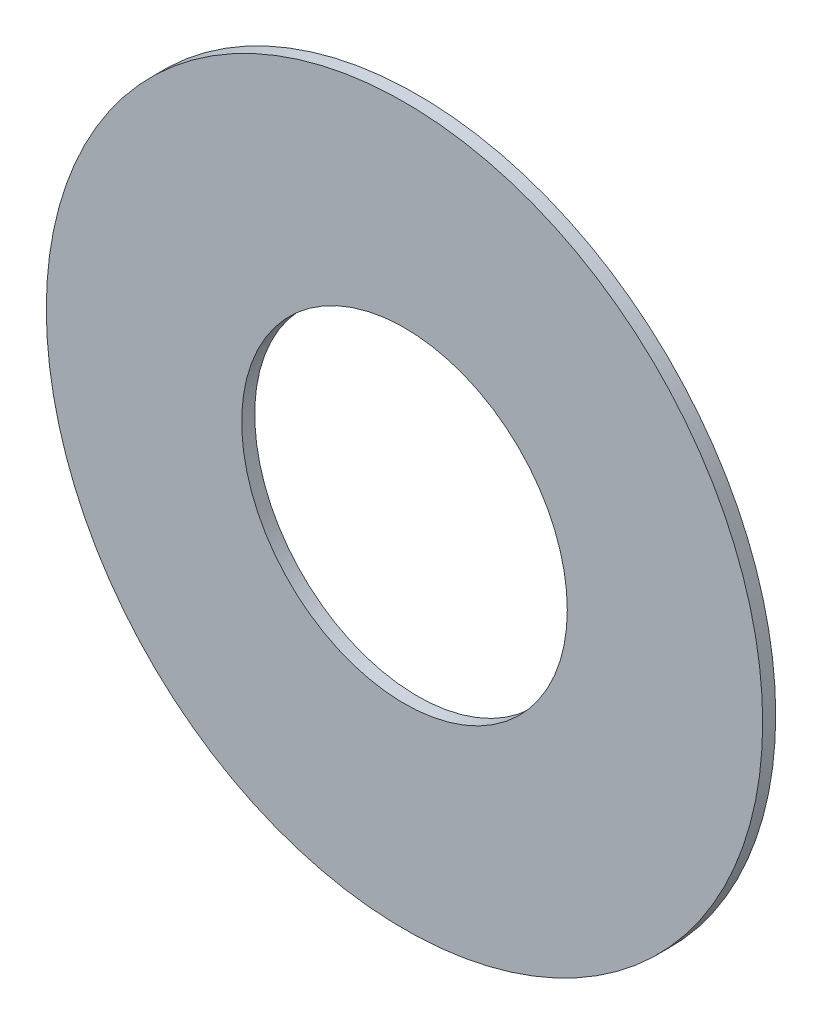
ISO-10303-21;
HEADER;
FILE_DESCRIPTION(('STEP AP214'),'2;1');
FILE_NAME('part.step','',(''),(''),'','','');
FILE_SCHEMA(('AUTOMOTIVE_DESIGN { 1 0 10303 214 1 1 1 1 }'));
ENDSEC;
DATA;
#1=APPLICATION_CONTEXT('core data for automotive mechanical design processes');
#2=APPLICATION_PROTOCOL_DEFINITION('international standard','automotive_design',2000,#1);
#3=PRODUCT_CONTEXT('',#1,'mechanical');
#4=PRODUCT('Part','Part','',(#3));
#5=PRODUCT_RELATED_PRODUCT_CATEGORY('part','',(#4));
#6=PRODUCT_DEFINITION_FORMATION('','',#4);
#7=PRODUCT_DEFINITION_CONTEXT('part definition',#1,'design');
#8=PRODUCT_DEFINITION('design','',#6,#7);
#9=PRODUCT_DEFINITION_SHAPE('','',#8);
#10=(LENGTH_UNIT() NAMED_UNIT(*) SI_UNIT(.MILLI.,.METRE.));
#11=(NAMED_UNIT(*) PLANE_ANGLE_UNIT() SI_UNIT($,.RADIAN.));
#12=(NAMED_UNIT(*) SI_UNIT($,.STERADIAN.) SOLID_ANGLE_UNIT());
#13=UNCERTAINTY_MEASURE_WITH_UNIT(LENGTH_MEASURE(1.E-05),#10,'distance_accuracy_value','');
#14=(GEOMETRIC_REPRESENTATION_CONTEXT(3) GLOBAL_UNCERTAINTY_ASSIGNED_CONTEXT((#13)) GLOBAL_UNIT_ASSIGNED_CONTEXT((#10,
#11,#12)) REPRESENTATION_CONTEXT('',''));
#15=CARTESIAN_POINT('',(0.,0.,0.));
#16=DIRECTION('',(0.,0.,1.));
#17=DIRECTION('',(1.,0.,0.));
#18=AXIS2_PLACEMENT_3D('',#15,#16,#17);
#19=CARTESIAN_POINT('',(0.,0.,0.2));
#20=DIRECTION('',(0.,0.,1.));
#21=DIRECTION('',(1.,0.,0.));
#22=AXIS2_PLACEMENT_3D('',#19,#20,#21);
#23=PLANE('',#22);
#24=CARTESIAN_POINT('',(0.,0.,0.2));
#25=DIRECTION('',(0.,0.,1.));
#26=DIRECTION('',(1.,0.,0.));
#27=AXIS2_PLACEMENT_3D('',#24,#25,#26);
#28=CIRCLE('',#27,2.5);
#29=CARTESIAN_POINT('',(2.5,0.,0.2));
#30=VERTEX_POINT('',#29);
#31=EDGE_CURVE('E26',#30,#30,#28,.F.);
#32=ORIENTED_EDGE('',*,*,#31,.T.);
#33=EDGE_LOOP('',(#32));
#34=FACE_BOUND('',#33,.T.);
#35=CARTESIAN_POINT('',(0.,0.,0.2));
#36=DIRECTION('',(0.,0.,1.));
#37=DIRECTION('',(1.,0.,0.));
#38=AXIS2_PLACEMENT_3D('',#35,#36,#37);
#39=CIRCLE('',#38,5.5);
#40=CARTESIAN_POINT('',(5.5,0.,0.2));
#41=VERTEX_POINT('',#40);
#42=EDGE_CURVE('E17',#41,#41,#39,.F.);
#43=ORIENTED_EDGE('',*,*,#42,.F.);
#44=EDGE_LOOP('',(#43));
#45=FACE_BOUND('',#44,.T.);
#46=ADVANCED_FACE('F14',(#34,#45),#23,.T.);
#47=CARTESIAN_POINT('',(0.,0.,0.1));
#48=DIRECTION('',(0.,0.,1.));
#49=DIRECTION('',(1.,0.,0.));
#50=AXIS2_PLACEMENT_3D('',#47,#48,#49);
#51=CYLINDRICAL_SURFACE('',#50,5.5);
#52=CARTESIAN_POINT('',(0.,0.,0.));
#53=DIRECTION('',(0.,0.,1.));
#54=DIRECTION('',(1.,0.,0.));
#55=AXIS2_PLACEMENT_3D('',#52,#53,#54);
#56=CIRCLE('',#55,5.5);
#57=CARTESIAN_POINT('',(5.5,0.,0.));
#58=VERTEX_POINT('',#57);
#59=EDGE_CURVE('E21',#58,#58,#56,.T.);
#60=ORIENTED_EDGE('',*,*,#59,.T.);
#61=EDGE_LOOP('',(#60));
#62=FACE_BOUND('',#61,.T.);
#63=ORIENTED_EDGE('',*,*,#42,.T.);
#64=EDGE_LOOP('',(#63));
#65=FACE_BOUND('',#64,.T.);
#66=ADVANCED_FACE('F34',(#62,#65),#51,.T.);
#67=CARTESIAN_POINT('',(0.,0.,0.1));
#68=DIRECTION('',(0.,0.,1.));
#69=DIRECTION('',(1.,0.,0.));
#70=AXIS2_PLACEMENT_3D('',#67,#68,#69);
#71=CYLINDRICAL_SURFACE('',#70,2.5);
#72=CARTESIAN_POINT('',(0.,0.,0.));
#73=DIRECTION('',(0.,0.,1.));
#74=DIRECTION('',(1.,0.,0.));
#75=AXIS2_PLACEMENT_3D('',#72,#73,#74);
#76=CIRCLE('',#75,2.5);
#77=CARTESIAN_POINT('',(2.5,0.,0.));
#78=VERTEX_POINT('',#77);
#79=EDGE_CURVE('E10',#78,#78,#76,.F.);
#80=ORIENTED_EDGE('',*,*,#79,.T.);
#81=EDGE_LOOP('',(#80));
#82=FACE_BOUND('',#81,.T.);
#83=ORIENTED_EDGE('',*,*,#31,.F.);
#84=EDGE_LOOP('',(#83));
#85=FACE_BOUND('',#84,.T.);
#86=ADVANCED_FACE('F41',(#82,#85),#71,.F.);
#87=CARTESIAN_POINT('',(0.,0.,0.));
#88=DIRECTION('',(0.,0.,1.));
#89=DIRECTION('',(1.,0.,0.));
#90=AXIS2_PLACEMENT_3D('',#87,#88,#89);
#91=PLANE('',#90);
#92=ORIENTED_EDGE('',*,*,#79,.F.);
#93=EDGE_LOOP('',(#92));
#94=FACE_BOUND('',#93,.T.);
#95=ORIENTED_EDGE('',*,*,#59,.F.);
#96=EDGE_LOOP('',(#95));
#97=FACE_BOUND('',#96,.T.);
#98=ADVANCED_FACE('F43',(#94,#97),#91,.F.);
#99=CLOSED_SHELL('',(#46,#66,#86,#98));
#100=MANIFOLD_SOLID_BREP('B1',#99);
#101=ADVANCED_BREP_SHAPE_REPRESENTATION('',(#18,#100),#14);
#102=SHAPE_DEFINITION_REPRESENTATION(#9,#101);
ENDSEC;
END-ISO-10303-21;
